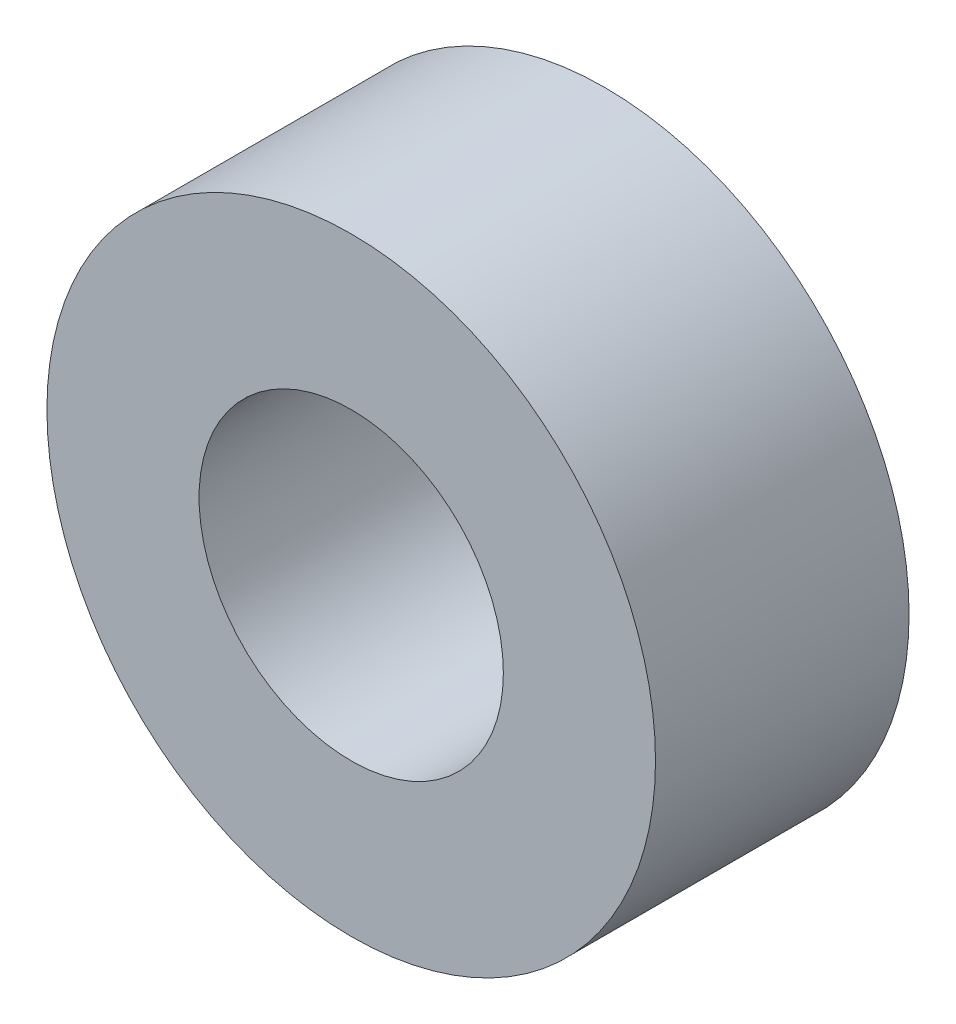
ISO-10303-21;
HEADER;
FILE_DESCRIPTION(('STEP AP214'),'2;1');
FILE_NAME('part.step','',(''),(''),'','','');
FILE_SCHEMA(('AUTOMOTIVE_DESIGN { 1 0 10303 214 1 1 1 1 }'));
ENDSEC;
DATA;
#1=APPLICATION_CONTEXT('core data for automotive mechanical design processes');
#2=APPLICATION_PROTOCOL_DEFINITION('international standard','automotive_design',2000,#1);
#3=PRODUCT_CONTEXT('',#1,'mechanical');
#4=PRODUCT('Part','Part','',(#3));
#5=PRODUCT_RELATED_PRODUCT_CATEGORY('part','',(#4));
#6=PRODUCT_DEFINITION_FORMATION('','',#4);
#7=PRODUCT_DEFINITION_CONTEXT('part definition',#1,'design');
#8=PRODUCT_DEFINITION('design','',#6,#7);
#9=PRODUCT_DEFINITION_SHAPE('','',#8);
#10=(LENGTH_UNIT() NAMED_UNIT(*) SI_UNIT(.MILLI.,.METRE.));
#11=(NAMED_UNIT(*) PLANE_ANGLE_UNIT() SI_UNIT($,.RADIAN.));
#12=(NAMED_UNIT(*) SI_UNIT($,.STERADIAN.) SOLID_ANGLE_UNIT());
#13=UNCERTAINTY_MEASURE_WITH_UNIT(LENGTH_MEASURE(1.E-05),#10,'distance_accuracy_value','');
#14=(GEOMETRIC_REPRESENTATION_CONTEXT(3) GLOBAL_UNCERTAINTY_ASSIGNED_CONTEXT((#13)) GLOBAL_UNIT_ASSIGNED_CONTEXT((#10,
#11,#12)) REPRESENTATION_CONTEXT('',''));
#15=CARTESIAN_POINT('',(0.,0.,0.));
#16=DIRECTION('',(0.,0.,1.));
#17=DIRECTION('',(1.,0.,0.));
#18=AXIS2_PLACEMENT_3D('',#15,#16,#17);
#19=CARTESIAN_POINT('',(0.,0.,6.35));
#20=DIRECTION('',(0.,0.,1.));
#21=DIRECTION('',(1.,0.,0.));
#22=AXIS2_PLACEMENT_3D('',#19,#20,#21);
#23=PLANE('',#22);
#24=CARTESIAN_POINT('',(0.,0.,6.35));
#25=DIRECTION('',(0.,0.,1.));
#26=DIRECTION('',(1.,0.,0.));
#27=AXIS2_PLACEMENT_3D('',#24,#25,#26);
#28=CIRCLE('',#27,7.62);
#29=CARTESIAN_POINT('',(7.62,0.,6.35));
#30=VERTEX_POINT('',#29);
#31=EDGE_CURVE('E10',#30,#30,#28,.T.);
#32=ORIENTED_EDGE('',*,*,#31,.T.);
#33=EDGE_LOOP('',(#32));
#34=FACE_BOUND('',#33,.T.);
#35=CARTESIAN_POINT('',(0.,0.,6.35));
#36=DIRECTION('',(0.,0.,1.));
#37=DIRECTION('',(1.,0.,0.));
#38=AXIS2_PLACEMENT_3D('',#35,#36,#37);
#39=CIRCLE('',#38,3.81);
#40=CARTESIAN_POINT('',(3.81,0.,6.35));
#41=VERTEX_POINT('',#40);
#42=EDGE_CURVE('E42',#41,#41,#39,.T.);
#43=ORIENTED_EDGE('',*,*,#42,.F.);
#44=EDGE_LOOP('',(#43));
#45=FACE_BOUND('',#44,.T.);
#46=ADVANCED_FACE('F31',(#34,#45),#23,.T.);
#47=CARTESIAN_POINT('',(0.,0.,0.));
#48=DIRECTION('',(0.,0.,1.));
#49=DIRECTION('',(1.,0.,0.));
#50=AXIS2_PLACEMENT_3D('',#47,#48,#49);
#51=PLANE('',#50);
#52=CARTESIAN_POINT('',(0.,0.,0.));
#53=DIRECTION('',(0.,0.,1.));
#54=DIRECTION('',(1.,0.,0.));
#55=AXIS2_PLACEMENT_3D('',#52,#53,#54);
#56=CIRCLE('',#55,7.62);
#57=CARTESIAN_POINT('',(7.62,0.,0.));
#58=VERTEX_POINT('',#57);
#59=EDGE_CURVE('E35',#58,#58,#56,.T.);
#60=ORIENTED_EDGE('',*,*,#59,.F.);
#61=EDGE_LOOP('',(#60));
#62=FACE_BOUND('',#61,.T.);
#63=CARTESIAN_POINT('',(0.,0.,0.));
#64=DIRECTION('',(0.,0.,1.));
#65=DIRECTION('',(1.,0.,0.));
#66=AXIS2_PLACEMENT_3D('',#63,#64,#65);
#67=CIRCLE('',#66,3.81);
#68=CARTESIAN_POINT('',(3.81,0.,0.));
#69=VERTEX_POINT('',#68);
#70=EDGE_CURVE('E44',#69,#69,#67,.T.);
#71=ORIENTED_EDGE('',*,*,#70,.T.);
#72=EDGE_LOOP('',(#71));
#73=FACE_BOUND('',#72,.T.);
#74=ADVANCED_FACE('F54',(#62,#73),#51,.F.);
#75=CARTESIAN_POINT('',(0.,0.,6.35));
#76=DIRECTION('',(0.,0.,-1.));
#77=DIRECTION('',(-1.,0.,0.));
#78=AXIS2_PLACEMENT_3D('',#75,#76,#77);
#79=CYLINDRICAL_SURFACE('',#78,7.62);
#80=ORIENTED_EDGE('',*,*,#31,.F.);
#81=EDGE_LOOP('',(#80));
#82=FACE_BOUND('',#81,.T.);
#83=ORIENTED_EDGE('',*,*,#59,.T.);
#84=EDGE_LOOP('',(#83));
#85=FACE_BOUND('',#84,.T.);
#86=ADVANCED_FACE('F33',(#82,#85),#79,.T.);
#87=CARTESIAN_POINT('',(0.,0.,6.35));
#88=DIRECTION('',(0.,0.,-1.));
#89=DIRECTION('',(-1.,0.,0.));
#90=AXIS2_PLACEMENT_3D('',#87,#88,#89);
#91=CYLINDRICAL_SURFACE('',#90,3.81);
#92=ORIENTED_EDGE('',*,*,#42,.T.);
#93=EDGE_LOOP('',(#92));
#94=FACE_BOUND('',#93,.T.);
#95=ORIENTED_EDGE('',*,*,#70,.F.);
#96=EDGE_LOOP('',(#95));
#97=FACE_BOUND('',#96,.T.);
#98=ADVANCED_FACE('F50',(#94,#97),#91,.F.);
#99=CLOSED_SHELL('',(#46,#74,#86,#98));
#100=MANIFOLD_SOLID_BREP('B2',#99);
#101=ADVANCED_BREP_SHAPE_REPRESENTATION('',(#18,#100),#14);
#102=SHAPE_DEFINITION_REPRESENTATION(#9,#101);
ENDSEC;
END-ISO-10303-21;
